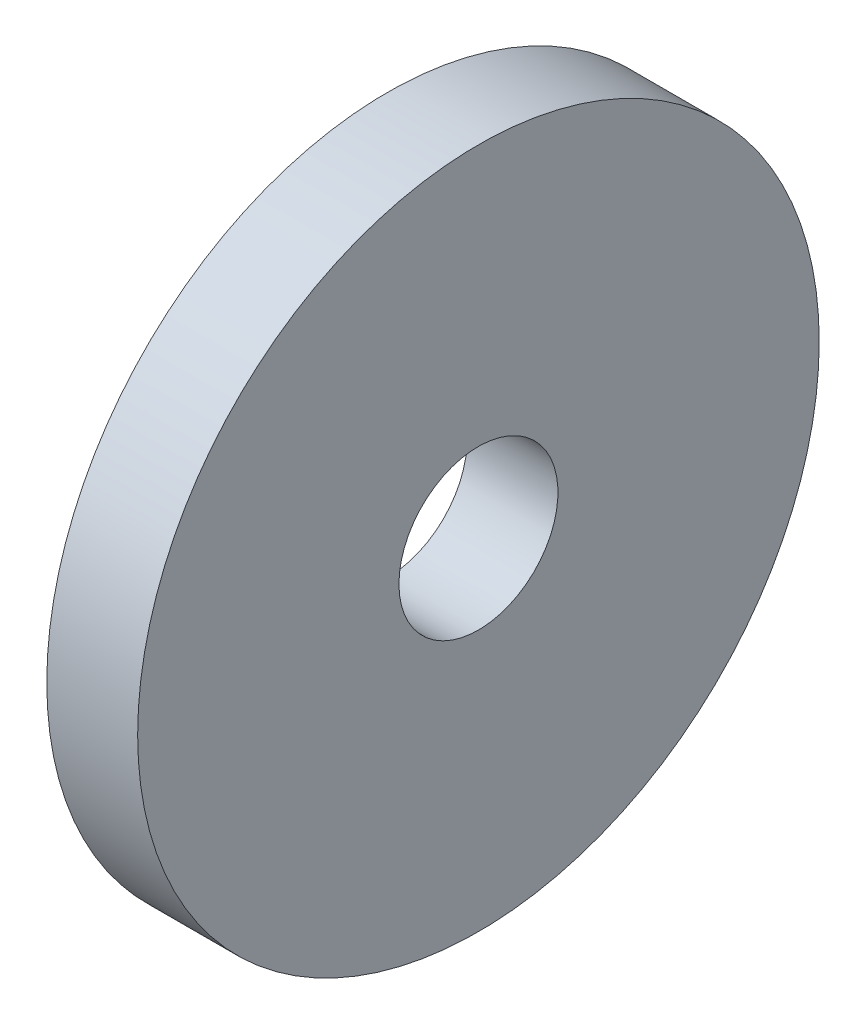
ISO-10303-21;
HEADER;
FILE_DESCRIPTION(('STEP AP214'),'2;1');
FILE_NAME('part.step','',(''),(''),'','','');
FILE_SCHEMA(('AUTOMOTIVE_DESIGN { 1 0 10303 214 1 1 1 1 }'));
ENDSEC;
DATA;
#1=APPLICATION_CONTEXT('core data for automotive mechanical design processes');
#2=APPLICATION_PROTOCOL_DEFINITION('international standard','automotive_design',2000,#1);
#3=PRODUCT_CONTEXT('',#1,'mechanical');
#4=PRODUCT('Part','Part','',(#3));
#5=PRODUCT_RELATED_PRODUCT_CATEGORY('part','',(#4));
#6=PRODUCT_DEFINITION_FORMATION('','',#4);
#7=PRODUCT_DEFINITION_CONTEXT('part definition',#1,'design');
#8=PRODUCT_DEFINITION('design','',#6,#7);
#9=PRODUCT_DEFINITION_SHAPE('','',#8);
#10=(LENGTH_UNIT() NAMED_UNIT(*) SI_UNIT(.MILLI.,.METRE.));
#11=(NAMED_UNIT(*) PLANE_ANGLE_UNIT() SI_UNIT($,.RADIAN.));
#12=(NAMED_UNIT(*) SI_UNIT($,.STERADIAN.) SOLID_ANGLE_UNIT());
#13=UNCERTAINTY_MEASURE_WITH_UNIT(LENGTH_MEASURE(1.E-05),#10,'distance_accuracy_value','');
#14=(GEOMETRIC_REPRESENTATION_CONTEXT(3) GLOBAL_UNCERTAINTY_ASSIGNED_CONTEXT((#13)) GLOBAL_UNIT_ASSIGNED_CONTEXT((#10,
#11,#12)) REPRESENTATION_CONTEXT('',''));
#15=CARTESIAN_POINT('',(0.,0.,0.));
#16=DIRECTION('',(0.,0.,1.));
#17=DIRECTION('',(1.,0.,0.));
#18=AXIS2_PLACEMENT_3D('',#15,#16,#17);
#19=CARTESIAN_POINT('',(-12.5747225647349,0.499999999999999,0.));
#20=DIRECTION('',(-1.,0.,0.));
#21=DIRECTION('',(0.,0.,1.));
#22=AXIS2_PLACEMENT_3D('',#19,#20,#21);
#23=CYLINDRICAL_SURFACE('',#22,15.);
#24=CARTESIAN_POINT('',(1.11022302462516E-13,0.499999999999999,0.));
#25=DIRECTION('',(-1.,0.,0.));
#26=DIRECTION('',(0.,0.,1.));
#27=AXIS2_PLACEMENT_3D('',#24,#25,#26);
#28=CIRCLE('',#27,15.);
#29=CARTESIAN_POINT('',(1.11022302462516E-13,0.499999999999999,15.));
#30=VERTEX_POINT('',#29);
#31=EDGE_CURVE('E10',#30,#30,#28,.T.);
#32=ORIENTED_EDGE('',*,*,#31,.F.);
#33=EDGE_LOOP('',(#32));
#34=FACE_BOUND('',#33,.T.);
#35=CARTESIAN_POINT('',(4.00000000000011,0.499999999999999,0.));
#36=DIRECTION('',(-1.,0.,0.));
#37=DIRECTION('',(0.,0.,1.));
#38=AXIS2_PLACEMENT_3D('',#35,#36,#37);
#39=CIRCLE('',#38,15.);
#40=CARTESIAN_POINT('',(4.00000000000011,0.499999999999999,15.));
#41=VERTEX_POINT('',#40);
#42=EDGE_CURVE('E44',#41,#41,#39,.T.);
#43=ORIENTED_EDGE('',*,*,#42,.T.);
#44=EDGE_LOOP('',(#43));
#45=FACE_BOUND('',#44,.T.);
#46=ADVANCED_FACE('F30',(#34,#45),#23,.T.);
#47=CARTESIAN_POINT('',(1.11022302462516E-13,4.,0.));
#48=DIRECTION('',(1.,0.,0.));
#49=DIRECTION('',(0.,0.,-1.));
#50=AXIS2_PLACEMENT_3D('',#47,#48,#49);
#51=PLANE('',#50);
#52=CARTESIAN_POINT('',(1.11022302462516E-13,0.499999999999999,0.));
#53=DIRECTION('',(-1.,0.,0.));
#54=DIRECTION('',(0.,0.,1.));
#55=AXIS2_PLACEMENT_3D('',#52,#53,#54);
#56=CIRCLE('',#55,3.5);
#57=CARTESIAN_POINT('',(1.11022302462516E-13,0.499999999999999,3.5));
#58=VERTEX_POINT('',#57);
#59=EDGE_CURVE('E36',#58,#58,#56,.T.);
#60=ORIENTED_EDGE('',*,*,#59,.F.);
#61=EDGE_LOOP('',(#60));
#62=FACE_BOUND('',#61,.T.);
#63=ORIENTED_EDGE('',*,*,#31,.T.);
#64=EDGE_LOOP('',(#63));
#65=FACE_BOUND('',#64,.T.);
#66=ADVANCED_FACE('F59',(#62,#65),#51,.F.);
#67=CARTESIAN_POINT('',(-12.5747225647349,0.499999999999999,0.));
#68=DIRECTION('',(-1.,0.,0.));
#69=DIRECTION('',(0.,0.,1.));
#70=AXIS2_PLACEMENT_3D('',#67,#68,#69);
#71=CYLINDRICAL_SURFACE('',#70,3.5);
#72=CARTESIAN_POINT('',(4.00000000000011,0.499999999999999,0.));
#73=DIRECTION('',(-1.,0.,0.));
#74=DIRECTION('',(0.,0.,1.));
#75=AXIS2_PLACEMENT_3D('',#72,#73,#74);
#76=CIRCLE('',#75,3.5);
#77=CARTESIAN_POINT('',(4.00000000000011,0.499999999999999,3.5));
#78=VERTEX_POINT('',#77);
#79=EDGE_CURVE('E40',#78,#78,#76,.T.);
#80=ORIENTED_EDGE('',*,*,#79,.F.);
#81=EDGE_LOOP('',(#80));
#82=FACE_BOUND('',#81,.T.);
#83=ORIENTED_EDGE('',*,*,#59,.T.);
#84=EDGE_LOOP('',(#83));
#85=FACE_BOUND('',#84,.T.);
#86=ADVANCED_FACE('F54',(#82,#85),#71,.F.);
#87=CARTESIAN_POINT('',(4.00000000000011,15.5,0.));
#88=DIRECTION('',(-1.,0.,0.));
#89=DIRECTION('',(0.,0.,1.));
#90=AXIS2_PLACEMENT_3D('',#87,#88,#89);
#91=PLANE('',#90);
#92=ORIENTED_EDGE('',*,*,#42,.F.);
#93=EDGE_LOOP('',(#92));
#94=FACE_BOUND('',#93,.T.);
#95=ORIENTED_EDGE('',*,*,#79,.T.);
#96=EDGE_LOOP('',(#95));
#97=FACE_BOUND('',#96,.T.);
#98=ADVANCED_FACE('F51',(#94,#97),#91,.F.);
#99=CLOSED_SHELL('',(#46,#66,#86,#98));
#100=MANIFOLD_SOLID_BREP('B2',#99);
#101=ADVANCED_BREP_SHAPE_REPRESENTATION('',(#18,#100),#14);
#102=SHAPE_DEFINITION_REPRESENTATION(#9,#101);
ENDSEC;
END-ISO-10303-21;
